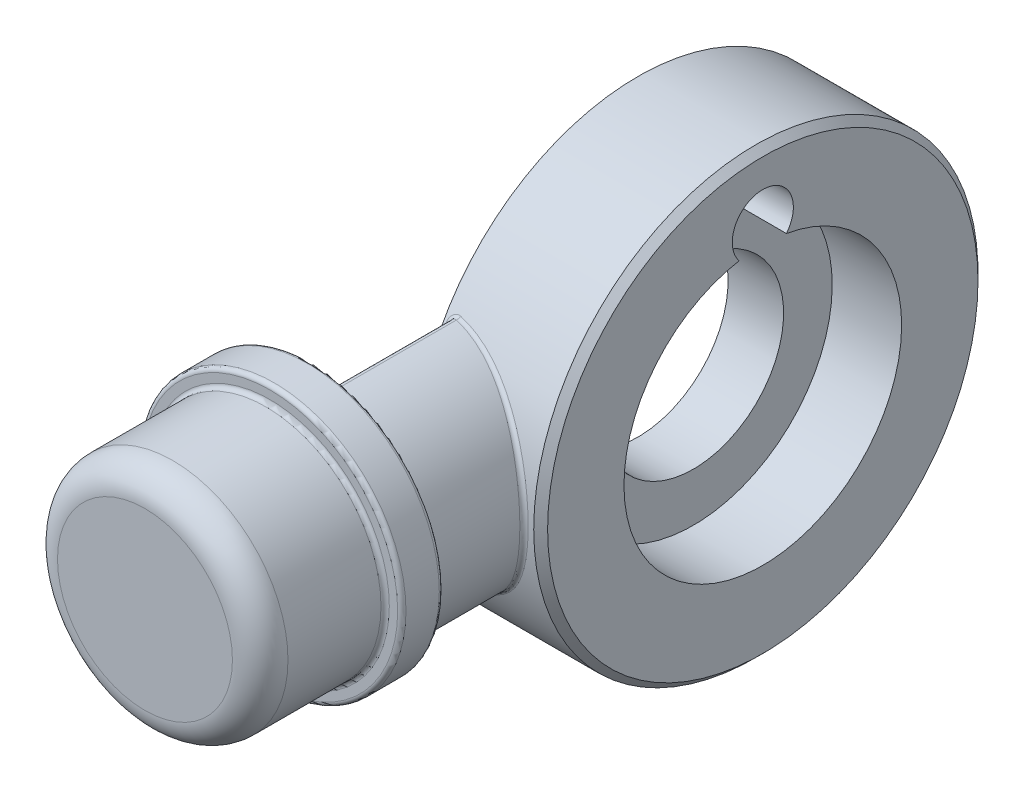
ISO-10303-21;
HEADER;
FILE_DESCRIPTION(('STEP AP214'),'2;1');
FILE_NAME('part.step','',(''),(''),'','','');
FILE_SCHEMA(('AUTOMOTIVE_DESIGN { 1 0 10303 214 1 1 1 1 }'));
ENDSEC;
DATA;
#1=APPLICATION_CONTEXT('core data for automotive mechanical design processes');
#2=APPLICATION_PROTOCOL_DEFINITION('international standard','automotive_design',2000,#1);
#3=PRODUCT_CONTEXT('',#1,'mechanical');
#4=PRODUCT('Part','Part','',(#3));
#5=PRODUCT_RELATED_PRODUCT_CATEGORY('part','',(#4));
#6=PRODUCT_DEFINITION_FORMATION('','',#4);
#7=PRODUCT_DEFINITION_CONTEXT('part definition',#1,'design');
#8=PRODUCT_DEFINITION('design','',#6,#7);
#9=PRODUCT_DEFINITION_SHAPE('','',#8);
#10=(LENGTH_UNIT() NAMED_UNIT(*) SI_UNIT(.MILLI.,.METRE.));
#11=(NAMED_UNIT(*) PLANE_ANGLE_UNIT() SI_UNIT($,.RADIAN.));
#12=(NAMED_UNIT(*) SI_UNIT($,.STERADIAN.) SOLID_ANGLE_UNIT());
#13=UNCERTAINTY_MEASURE_WITH_UNIT(LENGTH_MEASURE(1.E-05),#10,'distance_accuracy_value','');
#14=(GEOMETRIC_REPRESENTATION_CONTEXT(3) GLOBAL_UNCERTAINTY_ASSIGNED_CONTEXT((#13)) GLOBAL_UNIT_ASSIGNED_CONTEXT((#10,
#11,#12)) REPRESENTATION_CONTEXT('',''));
#15=CARTESIAN_POINT('',(0.,0.,0.));
#16=DIRECTION('',(0.,0.,1.));
#17=DIRECTION('',(1.,0.,0.));
#18=AXIS2_PLACEMENT_3D('',#15,#16,#17);
#19=CARTESIAN_POINT('',(0.,0.,35.));
#20=DIRECTION('',(0.,0.,1.));
#21=DIRECTION('',(0.,-1.,0.));
#22=AXIS2_PLACEMENT_3D('',#19,#20,#21);
#23=PLANE('',#22);
#24=CARTESIAN_POINT('',(0.,0.,35.));
#25=DIRECTION('',(0.,0.,-1.));
#26=DIRECTION('',(-1.,0.,0.));
#27=AXIS2_PLACEMENT_3D('',#24,#25,#26);
#28=CIRCLE('',#27,6.3);
#29=CARTESIAN_POINT('',(-6.3,0.,35.));
#30=VERTEX_POINT('',#29);
#31=CARTESIAN_POINT('',(6.3,0.,35.));
#32=VERTEX_POINT('',#31);
#33=EDGE_CURVE('E677',#30,#32,#28,.T.);
#34=ORIENTED_EDGE('',*,*,#33,.F.);
#35=CARTESIAN_POINT('',(0.,0.,35.));
#36=DIRECTION('',(0.,0.,-1.));
#37=DIRECTION('',(1.,0.,0.));
#38=AXIS2_PLACEMENT_3D('',#35,#36,#37);
#39=CIRCLE('',#38,6.3);
#40=EDGE_CURVE('E707',#32,#30,#39,.T.);
#41=ORIENTED_EDGE('',*,*,#40,.F.);
#42=EDGE_LOOP('',(#34,#41));
#43=FACE_BOUND('',#42,.T.);
#44=ADVANCED_FACE('F17',(#43),#23,.T.);
#45=CARTESIAN_POINT('',(0.,0.,33.));
#46=DIRECTION('',(0.,0.,1.));
#47=DIRECTION('',(1.,0.,0.));
#48=AXIS2_PLACEMENT_3D('',#45,#46,#47);
#49=TOROIDAL_SURFACE('',#48,6.3,2.);
#50=ORIENTED_EDGE('',*,*,#40,.T.);
#51=ORIENTED_EDGE('',*,*,#33,.T.);
#52=EDGE_LOOP('',(#50,#51));
#53=FACE_BOUND('',#52,.T.);
#54=CARTESIAN_POINT('',(0.,0.,33.));
#55=DIRECTION('',(0.,0.,-1.));
#56=DIRECTION('',(0.,1.,0.));
#57=AXIS2_PLACEMENT_3D('',#54,#55,#56);
#58=CIRCLE('',#57,8.3);
#59=CARTESIAN_POINT('',(0.,8.3,33.));
#60=VERTEX_POINT('',#59);
#61=EDGE_CURVE('E674',#60,#60,#58,.T.);
#62=ORIENTED_EDGE('',*,*,#61,.F.);
#63=EDGE_LOOP('',(#62));
#64=FACE_BOUND('',#63,.T.);
#65=ADVANCED_FACE('F682',(#53,#64),#49,.T.);
#66=CARTESIAN_POINT('',(0.,0.,35.));
#67=DIRECTION('',(0.,0.,-1.));
#68=DIRECTION('',(0.,1.,0.));
#69=AXIS2_PLACEMENT_3D('',#66,#67,#68);
#70=CYLINDRICAL_SURFACE('',#69,8.3);
#71=CARTESIAN_POINT('',(0.,0.,26.3));
#72=DIRECTION('',(0.,0.,1.));
#73=DIRECTION('',(1.,0.,0.));
#74=AXIS2_PLACEMENT_3D('',#71,#72,#73);
#75=CIRCLE('',#74,8.3);
#76=CARTESIAN_POINT('',(8.3,0.,26.3));
#77=VERTEX_POINT('',#76);
#78=EDGE_CURVE('E666',#77,#77,#75,.T.);
#79=ORIENTED_EDGE('',*,*,#78,.T.);
#80=EDGE_LOOP('',(#79));
#81=FACE_BOUND('',#80,.T.);
#82=ORIENTED_EDGE('',*,*,#61,.T.);
#83=EDGE_LOOP('',(#82));
#84=FACE_BOUND('',#83,.T.);
#85=ADVANCED_FACE('F656',(#81,#84),#70,.T.);
#86=CARTESIAN_POINT('',(0.,0.,26.3));
#87=DIRECTION('',(0.,0.,1.));
#88=DIRECTION('',(1.,0.,0.));
#89=AXIS2_PLACEMENT_3D('',#86,#87,#88);
#90=TOROIDAL_SURFACE('',#89,8.6,0.3);
#91=ORIENTED_EDGE('',*,*,#78,.F.);
#92=EDGE_LOOP('',(#91));
#93=FACE_BOUND('',#92,.T.);
#94=CARTESIAN_POINT('',(0.,0.,26.));
#95=DIRECTION('',(0.,0.,1.));
#96=DIRECTION('',(-1.,0.,0.));
#97=AXIS2_PLACEMENT_3D('',#94,#95,#96);
#98=CIRCLE('',#97,8.6);
#99=CARTESIAN_POINT('',(8.6,0.,26.));
#100=VERTEX_POINT('',#99);
#101=CARTESIAN_POINT('',(-8.6,0.,26.));
#102=VERTEX_POINT('',#101);
#103=EDGE_CURVE('E644',#100,#102,#98,.F.);
#104=ORIENTED_EDGE('',*,*,#103,.F.);
#105=CARTESIAN_POINT('',(0.,0.,26.));
#106=DIRECTION('',(0.,0.,1.));
#107=DIRECTION('',(1.,0.,0.));
#108=AXIS2_PLACEMENT_3D('',#105,#106,#107);
#109=CIRCLE('',#108,8.6);
#110=EDGE_CURVE('E662',#102,#100,#109,.F.);
#111=ORIENTED_EDGE('',*,*,#110,.F.);
#112=EDGE_LOOP('',(#104,#111));
#113=FACE_BOUND('',#112,.T.);
#114=ADVANCED_FACE('F647',(#93,#113),#90,.F.);
#115=CARTESIAN_POINT('',(0.,0.,26.));
#116=DIRECTION('',(0.,0.,1.));
#117=DIRECTION('',(0.,-1.,0.));
#118=AXIS2_PLACEMENT_3D('',#115,#116,#117);
#119=PLANE('',#118);
#120=CARTESIAN_POINT('',(0.,0.,26.));
#121=DIRECTION('',(0.,0.,-1.));
#122=DIRECTION('',(-1.,0.,0.));
#123=AXIS2_PLACEMENT_3D('',#120,#121,#122);
#124=CIRCLE('',#123,9.2);
#125=CARTESIAN_POINT('',(-9.2,0.,26.));
#126=VERTEX_POINT('',#125);
#127=CARTESIAN_POINT('',(9.2,0.,26.));
#128=VERTEX_POINT('',#127);
#129=EDGE_CURVE('E996',#126,#128,#124,.T.);
#130=ORIENTED_EDGE('',*,*,#129,.F.);
#131=CARTESIAN_POINT('',(0.,0.,26.));
#132=DIRECTION('',(0.,0.,-1.));
#133=DIRECTION('',(1.,0.,0.));
#134=AXIS2_PLACEMENT_3D('',#131,#132,#133);
#135=CIRCLE('',#134,9.2);
#136=EDGE_CURVE('E604',#128,#126,#135,.T.);
#137=ORIENTED_EDGE('',*,*,#136,.F.);
#138=EDGE_LOOP('',(#130,#137));
#139=FACE_BOUND('',#138,.T.);
#140=ORIENTED_EDGE('',*,*,#103,.T.);
#141=ORIENTED_EDGE('',*,*,#110,.T.);
#142=EDGE_LOOP('',(#140,#141));
#143=FACE_BOUND('',#142,.T.);
#144=ADVANCED_FACE('F619',(#139,#143),#119,.T.);
#145=CARTESIAN_POINT('',(0.,0.,25.7));
#146=DIRECTION('',(0.,0.,1.));
#147=DIRECTION('',(1.,0.,0.));
#148=AXIS2_PLACEMENT_3D('',#145,#146,#147);
#149=TOROIDAL_SURFACE('',#148,9.2,0.3);
#150=CARTESIAN_POINT('',(0.,0.,25.7));
#151=DIRECTION('',(0.,0.,1.));
#152=DIRECTION('',(0.,-1.,0.));
#153=AXIS2_PLACEMENT_3D('',#150,#151,#152);
#154=CIRCLE('',#153,9.5);
#155=CARTESIAN_POINT('',(0.,-9.5,25.7));
#156=VERTEX_POINT('',#155);
#157=EDGE_CURVE('E599',#156,#156,#154,.F.);
#158=ORIENTED_EDGE('',*,*,#157,.F.);
#159=EDGE_LOOP('',(#158));
#160=FACE_BOUND('',#159,.T.);
#161=ORIENTED_EDGE('',*,*,#136,.T.);
#162=ORIENTED_EDGE('',*,*,#129,.T.);
#163=EDGE_LOOP('',(#161,#162));
#164=FACE_BOUND('',#163,.T.);
#165=ADVANCED_FACE('F613',(#160,#164),#149,.T.);
#166=CARTESIAN_POINT('',(0.,0.,23.));
#167=DIRECTION('',(0.,0.,1.));
#168=DIRECTION('',(0.,-1.,0.));
#169=AXIS2_PLACEMENT_3D('',#166,#167,#168);
#170=CYLINDRICAL_SURFACE('',#169,9.5);
#171=CARTESIAN_POINT('',(0.,0.,23.3));
#172=DIRECTION('',(0.,0.,1.));
#173=DIRECTION('',(1.,0.,0.));
#174=AXIS2_PLACEMENT_3D('',#171,#172,#173);
#175=CIRCLE('',#174,9.5);
#176=CARTESIAN_POINT('',(9.5,0.,23.3));
#177=VERTEX_POINT('',#176);
#178=EDGE_CURVE('E596',#177,#177,#175,.F.);
#179=ORIENTED_EDGE('',*,*,#178,.F.);
#180=EDGE_LOOP('',(#179));
#181=FACE_BOUND('',#180,.T.);
#182=ORIENTED_EDGE('',*,*,#157,.T.);
#183=EDGE_LOOP('',(#182));
#184=FACE_BOUND('',#183,.T.);
#185=ADVANCED_FACE('F618',(#181,#184),#170,.T.);
#186=CARTESIAN_POINT('',(0.,0.,23.3));
#187=DIRECTION('',(0.,0.,1.));
#188=DIRECTION('',(1.,0.,0.));
#189=AXIS2_PLACEMENT_3D('',#186,#187,#188);
#190=TOROIDAL_SURFACE('',#189,9.2,0.3);
#191=CARTESIAN_POINT('',(0.,0.,23.));
#192=DIRECTION('',(0.,0.,1.));
#193=DIRECTION('',(1.,0.,0.));
#194=AXIS2_PLACEMENT_3D('',#191,#192,#193);
#195=CIRCLE('',#194,9.2);
#196=CARTESIAN_POINT('',(9.2,0.,23.));
#197=VERTEX_POINT('',#196);
#198=CARTESIAN_POINT('',(-9.2,0.,23.));
#199=VERTEX_POINT('',#198);
#200=EDGE_CURVE('E592',#197,#199,#195,.T.);
#201=ORIENTED_EDGE('',*,*,#200,.T.);
#202=CARTESIAN_POINT('',(0.,0.,23.));
#203=DIRECTION('',(0.,0.,1.));
#204=DIRECTION('',(-1.,0.,0.));
#205=AXIS2_PLACEMENT_3D('',#202,#203,#204);
#206=CIRCLE('',#205,9.2);
#207=EDGE_CURVE('E590',#199,#197,#206,.T.);
#208=ORIENTED_EDGE('',*,*,#207,.T.);
#209=EDGE_LOOP('',(#201,#208));
#210=FACE_BOUND('',#209,.T.);
#211=ORIENTED_EDGE('',*,*,#178,.T.);
#212=EDGE_LOOP('',(#211));
#213=FACE_BOUND('',#212,.T.);
#214=ADVANCED_FACE('F748',(#210,#213),#190,.T.);
#215=CARTESIAN_POINT('',(1.3,7.89366834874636,22.7));
#216=DIRECTION('',(0.,0.,1.));
#217=DIRECTION('',(1.,0.,0.));
#218=AXIS2_PLACEMENT_3D('',#215,#216,#217);
#219=TOROIDAL_SURFACE('',#218,0.6,0.3);
#220=CARTESIAN_POINT('',(1.3975,8.48569347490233,22.7));
#221=DIRECTION('',(-0.986708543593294,0.1625,0.));
#222=DIRECTION('',(0.1625,0.986708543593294,0.));
#223=AXIS2_PLACEMENT_3D('',#220,#221,#222);
#224=CIRCLE('',#223,0.3);
#225=CARTESIAN_POINT('',(1.3975,8.48569347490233,23.));
#226=VERTEX_POINT('',#225);
#227=CARTESIAN_POINT('',(1.34875,8.18968091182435,22.7));
#228=VERTEX_POINT('',#227);
#229=EDGE_CURVE('E237',#226,#228,#224,.F.);
#230=ORIENTED_EDGE('',*,*,#229,.T.);
#231=CARTESIAN_POINT('',(1.3,7.89366834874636,22.7));
#232=DIRECTION('',(0.,0.,-1.));
#233=DIRECTION('',(0.,1.,0.));
#234=AXIS2_PLACEMENT_3D('',#231,#232,#233);
#235=CIRCLE('',#234,0.3);
#236=CARTESIAN_POINT('',(1.,7.89366834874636,22.7));
#237=VERTEX_POINT('',#236);
#238=EDGE_CURVE('E500',#237,#228,#235,.T.);
#239=ORIENTED_EDGE('',*,*,#238,.F.);
#240=CARTESIAN_POINT('',(0.700000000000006,7.89366834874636,22.7));
#241=DIRECTION('',(0.,1.,0.));
#242=DIRECTION('',(0.,0.,1.));
#243=AXIS2_PLACEMENT_3D('',#240,#241,#242);
#244=CIRCLE('',#243,0.300000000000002);
#245=CARTESIAN_POINT('',(0.7,7.89366834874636,23.));
#246=VERTEX_POINT('',#245);
#247=EDGE_CURVE('E487',#237,#246,#244,.F.);
#248=ORIENTED_EDGE('',*,*,#247,.T.);
#249=CARTESIAN_POINT('',(1.3,7.89366834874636,23.));
#250=DIRECTION('',(0.,0.,-1.));
#251=DIRECTION('',(-1.,0.,0.));
#252=AXIS2_PLACEMENT_3D('',#249,#250,#251);
#253=CIRCLE('',#252,0.600000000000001);
#254=EDGE_CURVE('E529',#246,#226,#253,.T.);
#255=ORIENTED_EDGE('',*,*,#254,.T.);
#256=EDGE_LOOP('',(#230,#239,#248,#255));
#257=FACE_BOUND('',#256,.T.);
#258=ADVANCED_FACE('F528',(#257),#219,.F.);
#259=CARTESIAN_POINT('',(0.,0.,23.));
#260=DIRECTION('',(0.,0.,1.));
#261=DIRECTION('',(0.,-1.,0.));
#262=AXIS2_PLACEMENT_3D('',#259,#260,#261);
#263=PLANE('',#262);
#264=CARTESIAN_POINT('',(1.30000000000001,-7.89366834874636,23.));
#265=DIRECTION('',(0.,0.,-1.));
#266=DIRECTION('',(0.162500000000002,-0.986708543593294,0.));
#267=AXIS2_PLACEMENT_3D('',#264,#265,#266);
#268=CIRCLE('',#267,0.600000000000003);
#269=CARTESIAN_POINT('',(0.700000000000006,-7.89366834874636,23.));
#270=VERTEX_POINT('',#269);
#271=CARTESIAN_POINT('',(1.39750000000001,-8.48569347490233,23.));
#272=VERTEX_POINT('',#271);
#273=EDGE_CURVE('E240',#270,#272,#268,.F.);
#274=ORIENTED_EDGE('',*,*,#273,.T.);
#275=CARTESIAN_POINT('',(0.,0.,23.));
#276=DIRECTION('',(0.,0.,-1.));
#277=DIRECTION('',(1.,0.,0.));
#278=AXIS2_PLACEMENT_3D('',#275,#276,#277);
#279=CIRCLE('',#278,8.6);
#280=CARTESIAN_POINT('',(8.6,0.,23.));
#281=VERTEX_POINT('',#280);
#282=EDGE_CURVE('E201',#272,#281,#279,.F.);
#283=ORIENTED_EDGE('',*,*,#282,.T.);
#284=CARTESIAN_POINT('',(0.,0.,23.));
#285=DIRECTION('',(0.,0.,-1.));
#286=DIRECTION('',(0.1625,0.986708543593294,0.));
#287=AXIS2_PLACEMENT_3D('',#284,#285,#286);
#288=CIRCLE('',#287,8.6);
#289=EDGE_CURVE('E234',#281,#226,#288,.F.);
#290=ORIENTED_EDGE('',*,*,#289,.T.);
#291=ORIENTED_EDGE('',*,*,#254,.F.);
#292=DIRECTION('',(0.,1.,0.));
#293=VECTOR('',#292,1.);
#294=CARTESIAN_POINT('',(0.700000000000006,0.,23.));
#295=LINE('',#294,#293);
#296=EDGE_CURVE('E484',#246,#270,#295,.F.);
#297=ORIENTED_EDGE('',*,*,#296,.T.);
#298=EDGE_LOOP('',(#274,#283,#290,#291,#297));
#299=FACE_BOUND('',#298,.T.);
#300=ORIENTED_EDGE('',*,*,#200,.F.);
#301=ORIENTED_EDGE('',*,*,#207,.F.);
#302=EDGE_LOOP('',(#300,#301));
#303=FACE_BOUND('',#302,.T.);
#304=ADVANCED_FACE('F548',(#299,#303),#263,.F.);
#305=CARTESIAN_POINT('',(1.30000000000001,-7.89366834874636,22.7));
#306=DIRECTION('',(0.,0.,1.));
#307=DIRECTION('',(1.,0.,0.));
#308=AXIS2_PLACEMENT_3D('',#305,#306,#307);
#309=TOROIDAL_SURFACE('',#308,0.6,0.3);
#310=CARTESIAN_POINT('',(0.700000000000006,-7.89366834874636,22.7));
#311=DIRECTION('',(0.,1.,0.));
#312=DIRECTION('',(0.,0.,1.));
#313=AXIS2_PLACEMENT_3D('',#310,#311,#312);
#314=CIRCLE('',#313,0.300000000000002);
#315=CARTESIAN_POINT('',(1.,-7.89366834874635,22.7));
#316=VERTEX_POINT('',#315);
#317=EDGE_CURVE('E474',#270,#316,#314,.T.);
#318=ORIENTED_EDGE('',*,*,#317,.T.);
#319=CARTESIAN_POINT('',(1.30000000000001,-7.89366834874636,22.7));
#320=DIRECTION('',(0.,0.,-1.));
#321=DIRECTION('',(0.,1.,0.));
#322=AXIS2_PLACEMENT_3D('',#319,#320,#321);
#323=CIRCLE('',#322,0.3);
#324=CARTESIAN_POINT('',(1.34875000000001,-8.18968091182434,22.7));
#325=VERTEX_POINT('',#324);
#326=EDGE_CURVE('E467',#325,#316,#323,.T.);
#327=ORIENTED_EDGE('',*,*,#326,.F.);
#328=CARTESIAN_POINT('',(1.39750000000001,-8.48569347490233,22.7));
#329=DIRECTION('',(0.986708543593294,0.162500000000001,0.));
#330=DIRECTION('',(0.162500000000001,-0.986708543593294,0.));
#331=AXIS2_PLACEMENT_3D('',#328,#329,#330);
#332=CIRCLE('',#331,0.3);
#333=EDGE_CURVE('E232',#325,#272,#332,.T.);
#334=ORIENTED_EDGE('',*,*,#333,.T.);
#335=ORIENTED_EDGE('',*,*,#273,.F.);
#336=EDGE_LOOP('',(#318,#327,#334,#335));
#337=FACE_BOUND('',#336,.T.);
#338=ADVANCED_FACE('F220',(#337),#309,.F.);
#339=CARTESIAN_POINT('',(0.,0.,22.7));
#340=DIRECTION('',(0.,0.,1.));
#341=DIRECTION('',(1.,0.,0.));
#342=AXIS2_PLACEMENT_3D('',#339,#340,#341);
#343=TOROIDAL_SURFACE('',#342,8.6,0.3);
#344=ORIENTED_EDGE('',*,*,#282,.F.);
#345=ORIENTED_EDGE('',*,*,#333,.F.);
#346=CARTESIAN_POINT('',(0.,0.,22.7));
#347=DIRECTION('',(0.,0.,-1.));
#348=DIRECTION('',(0.,1.,0.));
#349=AXIS2_PLACEMENT_3D('',#346,#347,#348);
#350=CIRCLE('',#349,8.3);
#351=EDGE_CURVE('E450',#228,#325,#350,.T.);
#352=ORIENTED_EDGE('',*,*,#351,.F.);
#353=ORIENTED_EDGE('',*,*,#229,.F.);
#354=ORIENTED_EDGE('',*,*,#289,.F.);
#355=EDGE_LOOP('',(#344,#345,#352,#353,#354));
#356=FACE_BOUND('',#355,.T.);
#357=ADVANCED_FACE('F208',(#356),#343,.F.);
#358=CARTESIAN_POINT('',(1.3,7.89366834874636,26.));
#359=DIRECTION('',(0.,0.,-1.));
#360=DIRECTION('',(0.,1.,0.));
#361=AXIS2_PLACEMENT_3D('',#358,#359,#360);
#362=CYLINDRICAL_SURFACE('',#361,0.3);
#363=CARTESIAN_POINT('',(0.999999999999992,7.89366834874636,14.261135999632));
#364=CARTESIAN_POINT('',(0.999999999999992,7.97460862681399,14.1715336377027));
#365=CARTESIAN_POINT('',(1.03259023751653,8.0550001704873,14.0783770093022));
#366=CARTESIAN_POINT('',(1.12819710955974,8.14340371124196,13.9731857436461));
#367=CARTESIAN_POINT('',(1.16770625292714,8.16676278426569,13.9448846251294));
#368=CARTESIAN_POINT('',(1.25488815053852,8.19374688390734,13.9120784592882));
#369=CARTESIAN_POINT('',(1.30298677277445,8.19721760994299,13.9078134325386));
#370=CARTESIAN_POINT('',(1.34875,8.18968091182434,13.9170042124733));
#371=(BOUNDED_CURVE() B_SPLINE_CURVE(3,(#363,#364,#365,#366,#367,#368,#369,#370),.UNSPECIFIED.,
.F.,.F.) B_SPLINE_CURVE_WITH_KNOTS((4,2,2,4),(0.000253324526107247,0.00080841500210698,
0.00108596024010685,0.00136350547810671),
.UNSPECIFIED.) CURVE() GEOMETRIC_REPRESENTATION_ITEM() RATIONAL_B_SPLINE_CURVE((1.,1.,1.,1.,1.,
1.,1.,1.)) REPRESENTATION_ITEM(''));
#372=CARTESIAN_POINT('',(1.34874999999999,8.18968091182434,13.9170042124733));
#373=VERTEX_POINT('',#372);
#374=CARTESIAN_POINT('',(1.,7.89366834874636,14.261135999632));
#375=VERTEX_POINT('',#374);
#376=EDGE_CURVE('E490',#373,#375,#371,.F.);
#377=ORIENTED_EDGE('',*,*,#376,.T.);
#378=DIRECTION('',(0.,0.,-1.));
#379=VECTOR('',#378,1.);
#380=CARTESIAN_POINT('',(1.,7.89366834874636,26.));
#381=LINE('',#380,#379);
#382=EDGE_CURVE('E445',#375,#237,#381,.F.);
#383=ORIENTED_EDGE('',*,*,#382,.T.);
#384=ORIENTED_EDGE('',*,*,#238,.T.);
#385=DIRECTION('',(0.,0.,-1.));
#386=VECTOR('',#385,1.);
#387=CARTESIAN_POINT('',(1.34875,8.18968091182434,26.));
#388=LINE('',#387,#386);
#389=EDGE_CURVE('E438',#373,#228,#388,.F.);
#390=ORIENTED_EDGE('',*,*,#389,.F.);
#391=EDGE_LOOP('',(#377,#383,#384,#390));
#392=FACE_BOUND('',#391,.T.);
#393=ADVANCED_FACE('F219',(#392),#362,.T.);
#394=CARTESIAN_POINT('',(0.700000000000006,0.,22.7));
#395=DIRECTION('',(0.,1.,0.));
#396=DIRECTION('',(0.,0.,1.));
#397=AXIS2_PLACEMENT_3D('',#394,#395,#396);
#398=CYLINDRICAL_SURFACE('',#397,0.300000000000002);
#399=ORIENTED_EDGE('',*,*,#296,.F.);
#400=ORIENTED_EDGE('',*,*,#247,.F.);
#401=DIRECTION('',(0.,1.,0.));
#402=VECTOR('',#401,1.);
#403=CARTESIAN_POINT('',(1.,8.23953882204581,22.7));
#404=LINE('',#403,#402);
#405=EDGE_CURVE('E477',#237,#316,#404,.F.);
#406=ORIENTED_EDGE('',*,*,#405,.T.);
#407=ORIENTED_EDGE('',*,*,#317,.F.);
#408=EDGE_LOOP('',(#399,#400,#406,#407));
#409=FACE_BOUND('',#408,.T.);
#410=ADVANCED_FACE('F514',(#409),#398,.F.);
#411=CARTESIAN_POINT('',(1.30000000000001,-7.89366834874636,26.));
#412=DIRECTION('',(0.,0.,-1.));
#413=DIRECTION('',(0.,1.,0.));
#414=AXIS2_PLACEMENT_3D('',#411,#412,#413);
#415=CYLINDRICAL_SURFACE('',#414,0.3);
#416=CARTESIAN_POINT('',(1.34875000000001,-8.18968091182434,13.9170042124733));
#417=CARTESIAN_POINT('',(1.30310075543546,-8.19719883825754,13.9078363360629));
#418=CARTESIAN_POINT('',(1.2550160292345,-8.19375729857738,13.9120655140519));
#419=CARTESIAN_POINT('',(1.16792811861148,-8.1668605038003,13.9447661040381));
#420=CARTESIAN_POINT('',(1.12842382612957,-8.14352706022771,13.9730355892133));
#421=CARTESIAN_POINT('',(1.03310125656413,-8.05564395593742,14.0776176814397));
#422=CARTESIAN_POINT('',(1.00000000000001,-7.97437483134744,14.1717924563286));
#423=CARTESIAN_POINT('',(1.00000000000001,-7.89366834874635,14.261135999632));
#424=(BOUNDED_CURVE() B_SPLINE_CURVE(3,(#416,#417,#418,#419,#420,#421,#422,#423),.UNSPECIFIED.,
.F.,.F.) B_SPLINE_CURVE_WITH_KNOTS((4,2,2,4),(0.000378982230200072,0.000656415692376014,
0.000933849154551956,0.00148871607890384),
.UNSPECIFIED.) CURVE() GEOMETRIC_REPRESENTATION_ITEM() RATIONAL_B_SPLINE_CURVE((1.,1.,1.,1.,1.,
0.999999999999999,0.999999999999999,0.999999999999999)) REPRESENTATION_ITEM(''));
#425=CARTESIAN_POINT('',(1.00000000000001,-7.89366834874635,14.261135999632));
#426=VERTEX_POINT('',#425);
#427=CARTESIAN_POINT('',(1.34875000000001,-8.18968091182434,13.9170042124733));
#428=VERTEX_POINT('',#427);
#429=EDGE_CURVE('E246',#426,#428,#424,.F.);
#430=ORIENTED_EDGE('',*,*,#429,.T.);
#431=DIRECTION('',(0.,0.,-1.));
#432=VECTOR('',#431,1.);
#433=CARTESIAN_POINT('',(1.34875000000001,-8.18968091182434,26.));
#434=LINE('',#433,#432);
#435=EDGE_CURVE('E446',#325,#428,#434,.T.);
#436=ORIENTED_EDGE('',*,*,#435,.F.);
#437=ORIENTED_EDGE('',*,*,#326,.T.);
#438=DIRECTION('',(0.,0.,-1.));
#439=VECTOR('',#438,1.);
#440=CARTESIAN_POINT('',(1.,-7.89366834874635,26.));
#441=LINE('',#440,#439);
#442=EDGE_CURVE('E333',#316,#426,#441,.T.);
#443=ORIENTED_EDGE('',*,*,#442,.T.);
#444=EDGE_LOOP('',(#430,#436,#437,#443));
#445=FACE_BOUND('',#444,.T.);
#446=ADVANCED_FACE('F431',(#445),#415,.T.);
#447=CARTESIAN_POINT('',(0.,0.,26.));
#448=DIRECTION('',(0.,0.,-1.));
#449=DIRECTION('',(0.,1.,0.));
#450=AXIS2_PLACEMENT_3D('',#447,#448,#449);
#451=CYLINDRICAL_SURFACE('',#450,8.3);
#452=CARTESIAN_POINT('',(1.34874999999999,8.18968091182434,13.9170042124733));
#453=CARTESIAN_POINT('',(1.83594176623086,8.10944580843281,13.9676946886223));
#454=CARTESIAN_POINT('',(2.30821024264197,7.98741197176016,14.0439826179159));
#455=CARTESIAN_POINT('',(3.22536895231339,7.66313119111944,14.2366473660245));
#456=CARTESIAN_POINT('',(3.67407366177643,7.45810481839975,14.3544359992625));
#457=CARTESIAN_POINT('',(4.51237128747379,6.98288265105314,14.608818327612));
#458=CARTESIAN_POINT('',(4.90546558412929,6.71228630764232,14.7457822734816));
#459=CARTESIAN_POINT('',(5.64344459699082,6.10490893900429,15.0265066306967));
#460=CARTESIAN_POINT('',(5.99025011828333,5.76513277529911,15.1713035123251));
#461=CARTESIAN_POINT('',(6.61421280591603,5.03706674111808,15.4470700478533));
#462=CARTESIAN_POINT('',(6.89406313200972,4.64729327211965,15.5789891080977));
#463=CARTESIAN_POINT('',(7.2649785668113,4.02106288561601,15.7601242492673));
#464=CARTESIAN_POINT('',(7.38083294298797,3.80434342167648,15.8179278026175));
#465=CARTESIAN_POINT('',(7.5918819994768,3.36348799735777,15.9248038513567));
#466=CARTESIAN_POINT('',(7.68745693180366,3.13890056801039,15.9740535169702));
#467=CARTESIAN_POINT('',(7.94443962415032,2.45247680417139,16.1079327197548));
#468=CARTESIAN_POINT('',(8.07651351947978,1.97740987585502,16.1788272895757));
#469=CARTESIAN_POINT('',(8.25553983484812,0.993117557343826,16.2755492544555));
#470=CARTESIAN_POINT('',(8.29978780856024,0.49919819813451,16.2998839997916));
#471=CARTESIAN_POINT('',(8.30021068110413,-0.492117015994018,16.300115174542));
#472=CARTESIAN_POINT('',(8.25555492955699,-0.993093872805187,16.2755572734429));
#473=CARTESIAN_POINT('',(8.07643541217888,-1.97777998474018,16.178785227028));
#474=CARTESIAN_POINT('',(7.94424507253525,-2.45260347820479,16.1078383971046));
#475=CARTESIAN_POINT('',(7.60363575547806,-3.3631855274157,15.9303785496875));
#476=CARTESIAN_POINT('',(7.3949311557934,-3.8002902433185,15.8236657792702));
#477=CARTESIAN_POINT('',(6.89970675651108,-4.63910114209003,15.5816673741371));
#478=CARTESIAN_POINT('',(6.61843984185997,-5.03129881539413,15.4490476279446));
#479=CARTESIAN_POINT('',(5.99820496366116,-5.75667012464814,15.1747119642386));
#480=CARTESIAN_POINT('',(5.65820276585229,-6.09159916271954,15.0323971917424));
#481=CARTESIAN_POINT('',(4.91417973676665,-6.70624160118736,14.7488290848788));
#482=CARTESIAN_POINT('',(4.51898381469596,-6.97856860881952,14.611034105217));
#483=CARTESIAN_POINT('',(3.89131294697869,-7.33522952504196,14.4202556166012));
#484=CARTESIAN_POINT('',(3.67615465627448,-7.44548350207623,14.3592939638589));
#485=CARTESIAN_POINT('',(3.23317470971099,-7.64826247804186,14.2444155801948));
#486=CARTESIAN_POINT('',(3.00477082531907,-7.74088483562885,14.1904302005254));
#487=CARTESIAN_POINT('',(2.31249393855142,-7.9863730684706,14.0446417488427));
#488=CARTESIAN_POINT('',(1.83776563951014,-8.10914543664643,13.967884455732));
#489=CARTESIAN_POINT('',(1.34875000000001,-8.18968091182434,13.9170042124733));
#490=(BOUNDED_CURVE() B_SPLINE_CURVE(3,(#452,#453,#454,#455,#456,#457,#458,#459,#460,#461,#462,
#463,#464,#465,#466,#467,#468,#469,#470,#471,#472,#473,#474,#475,#476,#477,#478,#479,#480,#481,
#482,#483,#484,#485,#486,#487,#488,#489),.UNSPECIFIED.,.F.,.F.) B_SPLINE_CURVE_WITH_KNOTS((4,2,
2,2,2,2,2,2,2,2,2,2,2,2,2,2,2,2,4),(0.00305825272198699,0.00459779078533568,0.00613732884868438,
0.00767686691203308,0.00921640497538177,0.0107559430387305,0.0115257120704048,
0.0122954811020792,0.0138350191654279,0.0153745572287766,0.0169140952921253,0.0184536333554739,
0.0199931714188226,0.0215327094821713,0.02307224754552,0.0246117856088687,0.0253815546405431,
0.0261513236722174,0.0276908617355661),
.UNSPECIFIED.) CURVE() GEOMETRIC_REPRESENTATION_ITEM() RATIONAL_B_SPLINE_CURVE((1.,1.,1.,1.,1.,
1.,1.,1.,1.,1.,1.,1.,1.,1.,1.,1.,1.,1.,1.,1.,1.,1.,1.,1.,1.,1.,1.,1.,1.,1.,1.,1.,1.,1.,1.,1.,1.,1.)) REPRESENTATION_ITEM(''));
#491=EDGE_CURVE('E313',#428,#373,#490,.F.);
#492=ORIENTED_EDGE('',*,*,#491,.T.);
#493=ORIENTED_EDGE('',*,*,#389,.T.);
#494=ORIENTED_EDGE('',*,*,#351,.T.);
#495=ORIENTED_EDGE('',*,*,#435,.T.);
#496=EDGE_LOOP('',(#492,#493,#494,#495));
#497=FACE_BOUND('',#496,.T.);
#498=ADVANCED_FACE('F427',(#497),#451,.T.);
#499=CARTESIAN_POINT('',(1.,8.23953882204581,26.));
#500=DIRECTION('',(1.,0.,0.));
#501=DIRECTION('',(0.,0.,-1.));
#502=AXIS2_PLACEMENT_3D('',#499,#500,#501);
#503=PLANE('',#502);
#504=ORIENTED_EDGE('',*,*,#442,.F.);
#505=ORIENTED_EDGE('',*,*,#405,.F.);
#506=ORIENTED_EDGE('',*,*,#382,.F.);
#507=CARTESIAN_POINT('',(1.00000000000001,0.,0.));
#508=DIRECTION('',(-1.,0.,0.));
#509=DIRECTION('',(0.,-0.48427413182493,0.874916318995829));
#510=AXIS2_PLACEMENT_3D('',#507,#508,#509);
#511=CIRCLE('',#510,16.3);
#512=EDGE_CURVE('E144',#375,#426,#511,.F.);
#513=ORIENTED_EDGE('',*,*,#512,.T.);
#514=EDGE_LOOP('',(#504,#505,#506,#513));
#515=FACE_BOUND('',#514,.T.);
#516=ADVANCED_FACE('F416',(#515),#503,.F.);
#517=CARTESIAN_POINT('',(4.5,0.,0.));
#518=DIRECTION('',(1.,0.,0.));
#519=DIRECTION('',(0.,0.,-1.));
#520=AXIS2_PLACEMENT_3D('',#517,#518,#519);
#521=CYLINDRICAL_SURFACE('',#520,10.);
#522=CARTESIAN_POINT('',(4.5,0.,0.));
#523=DIRECTION('',(1.,0.,0.));
#524=DIRECTION('',(0.,0.,-1.));
#525=AXIS2_PLACEMENT_3D('',#522,#523,#524);
#526=CIRCLE('',#525,10.);
#527=CARTESIAN_POINT('',(4.49999999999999,9.85433333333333,1.70062181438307));
#528=VERTEX_POINT('',#527);
#529=CARTESIAN_POINT('',(4.5,9.85433333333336,-1.70062181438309));
#530=VERTEX_POINT('',#529);
#531=EDGE_CURVE('E322',#528,#530,#526,.T.);
#532=ORIENTED_EDGE('',*,*,#531,.F.);
#533=DIRECTION('',(-1.,0.,0.));
#534=VECTOR('',#533,1.);
#535=CARTESIAN_POINT('',(15.7225396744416,9.85433333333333,1.70062181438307));
#536=LINE('',#535,#534);
#537=CARTESIAN_POINT('',(9.49999999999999,9.85433333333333,1.70062181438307));
#538=VERTEX_POINT('',#537);
#539=EDGE_CURVE('E398',#528,#538,#536,.F.);
#540=ORIENTED_EDGE('',*,*,#539,.T.);
#541=CARTESIAN_POINT('',(9.49999999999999,0.,0.));
#542=DIRECTION('',(1.,0.,0.));
#543=DIRECTION('',(0.,0.,-1.));
#544=AXIS2_PLACEMENT_3D('',#541,#542,#543);
#545=CIRCLE('',#544,10.);
#546=CARTESIAN_POINT('',(9.49999999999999,9.85433333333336,-1.70062181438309));
#547=VERTEX_POINT('',#546);
#548=EDGE_CURVE('E326',#547,#538,#545,.F.);
#549=ORIENTED_EDGE('',*,*,#548,.F.);
#550=DIRECTION('',(-1.,0.,0.));
#551=VECTOR('',#550,1.);
#552=CARTESIAN_POINT('',(15.7225396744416,9.85433333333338,-1.70062181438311));
#553=LINE('',#552,#551);
#554=EDGE_CURVE('E147',#547,#530,#553,.T.);
#555=ORIENTED_EDGE('',*,*,#554,.T.);
#556=EDGE_LOOP('',(#532,#540,#549,#555));
#557=FACE_BOUND('',#556,.T.);
#558=ADVANCED_FACE('F426',(#557),#521,.F.);
#559=CARTESIAN_POINT('',(9.49999999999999,0.,0.));
#560=DIRECTION('',(1.,0.,0.));
#561=DIRECTION('',(0.,0.,-1.));
#562=AXIS2_PLACEMENT_3D('',#559,#560,#561);
#563=PLANE('',#562);
#564=CARTESIAN_POINT('',(9.49999999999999,0.,0.));
#565=DIRECTION('',(-1.,0.,0.));
#566=DIRECTION('',(0.,0.,1.));
#567=AXIS2_PLACEMENT_3D('',#564,#565,#566);
#568=CIRCLE('',#567,15.5);
#569=CARTESIAN_POINT('',(9.49999999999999,0.,15.5));
#570=VERTEX_POINT('',#569);
#571=EDGE_CURVE('E315',#570,#570,#568,.T.);
#572=ORIENTED_EDGE('',*,*,#571,.F.);
#573=EDGE_LOOP('',(#572));
#574=FACE_BOUND('',#573,.T.);
#575=CARTESIAN_POINT('',(9.49999999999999,11.25,0.));
#576=DIRECTION('',(-1.,0.,0.));
#577=DIRECTION('',(0.,0.,1.));
#578=AXIS2_PLACEMENT_3D('',#575,#576,#577);
#579=CIRCLE('',#578,2.2);
#580=EDGE_CURVE('E123',#538,#547,#579,.T.);
#581=ORIENTED_EDGE('',*,*,#580,.T.);
#582=ORIENTED_EDGE('',*,*,#548,.T.);
#583=EDGE_LOOP('',(#581,#582));
#584=FACE_BOUND('',#583,.T.);
#585=ADVANCED_FACE('F808',(#574,#584),#563,.T.);
#586=CARTESIAN_POINT('',(4.5,0.,0.));
#587=DIRECTION('',(1.,0.,0.));
#588=DIRECTION('',(0.,0.,-1.));
#589=AXIS2_PLACEMENT_3D('',#586,#587,#588);
#590=PLANE('',#589);
#591=CARTESIAN_POINT('',(4.5,0.,0.));
#592=DIRECTION('',(-1.,0.,0.));
#593=DIRECTION('',(0.,0.,1.));
#594=AXIS2_PLACEMENT_3D('',#591,#592,#593);
#595=CIRCLE('',#594,6.5);
#596=CARTESIAN_POINT('',(4.5,0.,6.5));
#597=VERTEX_POINT('',#596);
#598=EDGE_CURVE('E156',#597,#597,#595,.T.);
#599=ORIENTED_EDGE('',*,*,#598,.T.);
#600=EDGE_LOOP('',(#599));
#601=FACE_BOUND('',#600,.T.);
#602=CARTESIAN_POINT('',(4.49999999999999,11.25,0.));
#603=DIRECTION('',(-1.,0.,0.));
#604=DIRECTION('',(0.,0.,1.));
#605=AXIS2_PLACEMENT_3D('',#602,#603,#604);
#606=CIRCLE('',#605,2.2);
#607=EDGE_CURVE('E329',#530,#528,#606,.T.);
#608=ORIENTED_EDGE('',*,*,#607,.T.);
#609=ORIENTED_EDGE('',*,*,#531,.T.);
#610=EDGE_LOOP('',(#608,#609));
#611=FACE_BOUND('',#610,.T.);
#612=ADVANCED_FACE('F177',(#601,#611),#590,.T.);
#613=CARTESIAN_POINT('',(0.699999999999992,7.74838610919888,13.9986611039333));
#614=CARTESIAN_POINT('',(0.999999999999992,7.74838610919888,13.9986611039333));
#615=CARTESIAN_POINT('',(0.999999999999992,7.89366834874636,14.261135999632));
#616=CARTESIAN_POINT('',(0.700000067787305,7.90739790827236,13.9106466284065));
#617=CARTESIAN_POINT('',(0.963057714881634,7.83975219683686,13.9480891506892));
#618=CARTESIAN_POINT('',(0.999999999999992,7.97460862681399,14.1715336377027));
#619=CARTESIAN_POINT('',(0.765180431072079,8.06511120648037,13.8192657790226));
#620=CARTESIAN_POINT('',(0.968199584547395,7.96442830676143,13.877765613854));
#621=CARTESIAN_POINT('',(1.03259023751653,8.0550001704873,14.0783770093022));
#622=CARTESIAN_POINT('',(0.956394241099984,8.2386640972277,13.7160105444));
#623=CARTESIAN_POINT('',(1.07495383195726,8.10881034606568,13.7939280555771));
#624=CARTESIAN_POINT('',(1.12819710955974,8.14340371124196,13.9731857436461));
#625=CARTESIAN_POINT('',(1.0354125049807,8.28452242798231,13.6882303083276));
#626=CARTESIAN_POINT('',(1.12434027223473,8.14839590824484,13.7706046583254));
#627=CARTESIAN_POINT('',(1.16770625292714,8.16676278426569,13.9448846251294));
#628=CARTESIAN_POINT('',(1.20977630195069,8.33749734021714,13.6560279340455));
#629=CARTESIAN_POINT('',(1.23846700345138,8.19352700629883,13.7439125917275));
#630=CARTESIAN_POINT('',(1.25488815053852,8.19374688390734,13.9120784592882));
#631=CARTESIAN_POINT('',(1.30604484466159,8.34429949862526,13.6518484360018));
#632=CARTESIAN_POINT('',(1.3045656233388,8.19957304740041,13.7403041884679));
#633=CARTESIAN_POINT('',(1.30298677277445,8.19721760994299,13.9078134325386));
#634=CARTESIAN_POINT('',(1.3975,8.32951506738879,13.6608630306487));
#635=CARTESIAN_POINT('',(1.3652936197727,8.18695636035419,13.7477861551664));
#636=CARTESIAN_POINT('',(1.34875,8.18968091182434,13.9170042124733));
#637=(BOUNDED_SURFACE() B_SPLINE_SURFACE(3,2,((#613,#614,#615),(#616,#617,#618),(#619,#620,
#621),(#622,#623,#624),(#625,#626,#627),(#628,#629,#630),(#631,#632,#633),(#634,#635,#636)),
.UNSPECIFIED.,.F.,.F.,.F.) B_SPLINE_SURFACE_WITH_KNOTS((4,2,2,4),(3,3),(0.000253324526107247,
0.00080841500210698,0.00108596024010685,0.00136350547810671),(0.,1.),
.UNSPECIFIED.) GEOMETRIC_REPRESENTATION_ITEM() RATIONAL_B_SPLINE_SURFACE(((1.,0.707106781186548,
1.),(1.,0.753385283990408,1.),(1.,0.79739799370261,1.),(1.,0.845220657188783,1.),(1.,
0.85772218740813,1.),(1.,0.872140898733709,1.),(1.,0.874071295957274,1.),(1.,0.869964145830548,1.))) REPRESENTATION_ITEM('') SURFACE());
#638=CARTESIAN_POINT('',(1.39749999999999,8.48569347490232,13.9170042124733));
#639=DIRECTION('',(0.981900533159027,-0.161708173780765,0.0985992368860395));
#640=DIRECTION('',(-0.162500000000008,-0.986708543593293,0.));
#641=AXIS2_PLACEMENT_3D('',#638,#639,#640);
#642=CIRCLE('',#641,0.299999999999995);
#643=CARTESIAN_POINT('',(1.39749999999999,8.32951506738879,13.6608630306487));
#644=VERTEX_POINT('',#643);
#645=EDGE_CURVE('E153',#373,#644,#642,.T.);
#646=CARTESIAN_POINT('',(1.3975,8.32951506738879,13.6608630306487));
#647=CARTESIAN_POINT('',(1.30604484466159,8.34429949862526,13.6518484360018));
#648=CARTESIAN_POINT('',(1.20977630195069,8.33749734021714,13.6560279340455));
#649=CARTESIAN_POINT('',(1.0354125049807,8.28452242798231,13.6882303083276));
#650=CARTESIAN_POINT('',(0.956394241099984,8.2386640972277,13.7160105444));
#651=CARTESIAN_POINT('',(0.765180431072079,8.06511120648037,13.8192657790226));
#652=CARTESIAN_POINT('',(0.700000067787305,7.90739790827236,13.9106466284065));
#653=CARTESIAN_POINT('',(0.699999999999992,7.74838610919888,13.9986611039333));
#654=(BOUNDED_CURVE() B_SPLINE_CURVE(3,(#646,#647,#648,#649,#650,#651,#652,#653),.UNSPECIFIED.,
.F.,.F.) B_SPLINE_CURVE_WITH_KNOTS((4,2,2,4),(0.000253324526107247,0.000530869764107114,
0.00080841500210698,0.00136350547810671),
.UNSPECIFIED.) CURVE() GEOMETRIC_REPRESENTATION_ITEM() RATIONAL_B_SPLINE_CURVE((1.,1.,1.,1.,1.,
1.,1.,1.)) REPRESENTATION_ITEM(''));
#655=CARTESIAN_POINT('',(0.700000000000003,7.74838610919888,13.9986611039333));
#656=VERTEX_POINT('',#655);
#657=EDGE_CURVE('E132',#656,#644,#654,.F.);
#658=CARTESIAN_POINT('',(0.700000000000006,7.89366834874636,14.261135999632));
#659=DIRECTION('',(0.,-0.874916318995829,0.48427413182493));
#660=DIRECTION('',(0.,0.48427413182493,0.874916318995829));
#661=AXIS2_PLACEMENT_3D('',#658,#659,#660);
#662=CIRCLE('',#661,0.3);
#663=EDGE_CURVE('E141',#656,#375,#662,.T.);
#664=ORIENTED_EDGE('',*,*,#376,.F.);
#665=ORIENTED_EDGE('',*,*,#645,.T.);
#666=ORIENTED_EDGE('',*,*,#657,.F.);
#667=ORIENTED_EDGE('',*,*,#663,.T.);
#668=EDGE_LOOP('',(#664,#665,#666,#667));
#669=FACE_BOUND('',#668,.T.);
#670=ADVANCED_FACE('F151',(#669),#637,.F.);
#671=CARTESIAN_POINT('',(8.99999999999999,0.,0.));
#672=DIRECTION('',(-1.,0.,0.));
#673=DIRECTION('',(0.,0.,1.));
#674=AXIS2_PLACEMENT_3D('',#671,#672,#673);
#675=CONICAL_SURFACE('',#674,16.,0.785398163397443);
#676=ORIENTED_EDGE('',*,*,#571,.T.);
#677=EDGE_LOOP('',(#676));
#678=FACE_BOUND('',#677,.T.);
#679=CARTESIAN_POINT('',(8.99999999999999,0.,0.));
#680=DIRECTION('',(-1.,0.,0.));
#681=DIRECTION('',(0.,0.,1.));
#682=AXIS2_PLACEMENT_3D('',#679,#680,#681);
#683=CIRCLE('',#682,16.);
#684=CARTESIAN_POINT('',(8.99999999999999,0.,16.));
#685=VERTEX_POINT('',#684);
#686=EDGE_CURVE('E366',#685,#685,#683,.T.);
#687=ORIENTED_EDGE('',*,*,#686,.F.);
#688=EDGE_LOOP('',(#687));
#689=FACE_BOUND('',#688,.T.);
#690=ADVANCED_FACE('F176',(#678,#689),#675,.T.);
#691=CARTESIAN_POINT('',(1.34875000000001,-8.18968091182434,13.9170042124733));
#692=CARTESIAN_POINT('',(1.36529361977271,-8.18695636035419,13.7477861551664));
#693=CARTESIAN_POINT('',(1.39750000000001,-8.32951506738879,13.6608630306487));
#694=CARTESIAN_POINT('',(1.83776563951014,-8.10914543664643,13.967884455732));
#695=CARTESIAN_POINT('',(1.86175021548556,-8.10417740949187,13.797082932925));
#696=CARTESIAN_POINT('',(1.90418994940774,-8.24760464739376,13.7108067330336));
#697=CARTESIAN_POINT('',(2.31249393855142,-7.9863730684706,14.0446417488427));
#698=CARTESIAN_POINT('',(2.34316826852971,-7.97760660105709,13.8716261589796));
#699=CARTESIAN_POINT('',(2.39607805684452,-8.12273585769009,13.786151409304));
#700=CARTESIAN_POINT('',(3.00477082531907,-7.74088483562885,14.1904302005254));
#701=CARTESIAN_POINT('',(3.0397529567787,-7.72741374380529,14.0115741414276));
#702=CARTESIAN_POINT('',(3.11337699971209,-7.87305605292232,13.929256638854));
#703=CARTESIAN_POINT('',(3.23317470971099,-7.64826247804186,14.2444155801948));
#704=CARTESIAN_POINT('',(3.27028451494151,-7.63261584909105,14.0635937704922));
#705=CARTESIAN_POINT('',(3.35003644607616,-7.77885222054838,13.9822484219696));
#706=CARTESIAN_POINT('',(3.67615465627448,-7.44548350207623,14.3592939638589));
#707=CARTESIAN_POINT('',(3.71671581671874,-7.42556439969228,14.1740104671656));
#708=CARTESIAN_POINT('',(3.80902771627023,-7.57261090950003,14.0950124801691));
#709=CARTESIAN_POINT('',(3.89131294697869,-7.33522952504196,14.4202556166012));
#710=CARTESIAN_POINT('',(3.9333936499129,-7.31293123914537,14.2325986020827));
#711=CARTESIAN_POINT('',(4.03196281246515,-7.46047440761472,14.1548521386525));
#712=CARTESIAN_POINT('',(4.51898381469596,-6.97856860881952,14.611034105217));
#713=CARTESIAN_POINT('',(4.56755357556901,-6.94769755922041,14.4163673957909));
#714=CARTESIAN_POINT('',(4.68232057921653,-7.0977237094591,14.3421193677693));
#715=CARTESIAN_POINT('',(4.91417973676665,-6.70624160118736,14.7488290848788));
#716=CARTESIAN_POINT('',(4.96413409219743,-6.66938494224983,14.5484963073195));
#717=CARTESIAN_POINT('',(5.09180069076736,-6.82074687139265,14.4773782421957));
#718=CARTESIAN_POINT('',(5.65820276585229,-6.09159916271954,15.0323971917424));
#719=CARTESIAN_POINT('',(5.70800413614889,-6.04594462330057,14.8185584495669));
#720=CARTESIAN_POINT('',(5.86271611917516,-6.19560976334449,14.755727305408));
#721=CARTESIAN_POINT('',(5.99820496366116,-5.75667012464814,15.1747119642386));
#722=CARTESIAN_POINT('',(6.04600427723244,-5.70635596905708,14.9535306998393));
#723=CARTESIAN_POINT('',(6.21500755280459,-5.85496200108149,14.8954227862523));
#724=CARTESIAN_POINT('',(6.61843984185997,-5.03129881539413,15.4490476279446));
#725=CARTESIAN_POINT('',(6.66127807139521,-4.97547277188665,15.2124812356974));
#726=CARTESIAN_POINT('',(6.8576605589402,-5.11720538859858,15.1647093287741));
#727=CARTESIAN_POINT('',(6.89970675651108,-4.63910114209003,15.5816673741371));
#728=CARTESIAN_POINT('',(6.93792472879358,-4.58132290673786,15.3367015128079));
#729=CARTESIAN_POINT('',(7.14909374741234,-4.71831116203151,15.29488821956));
#730=CARTESIAN_POINT('',(7.3949311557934,-3.8002902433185,15.8236657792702));
#731=CARTESIAN_POINT('',(7.42452020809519,-3.74304904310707,15.5626787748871));
#732=CARTESIAN_POINT('',(7.66221782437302,-3.8651780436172,15.5324326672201));
#733=CARTESIAN_POINT('',(7.60363575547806,-3.3631855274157,15.9303785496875));
#734=CARTESIAN_POINT('',(7.62694018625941,-3.30896112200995,15.661060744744));
#735=CARTESIAN_POINT('',(7.87846596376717,-3.42061001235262,15.6371813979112));
#736=CARTESIAN_POINT('',(7.94424507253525,-2.45260347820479,16.1078383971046));
#737=CARTESIAN_POINT('',(7.95827610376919,-2.40686025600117,15.8249204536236));
#738=CARTESIAN_POINT('',(8.2313864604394,-2.49448029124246,15.8113751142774));
#739=CARTESIAN_POINT('',(8.07643541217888,-1.97777998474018,16.178785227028));
#740=CARTESIAN_POINT('',(8.08495742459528,-1.94011378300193,15.889442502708));
#741=CARTESIAN_POINT('',(8.36835476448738,-2.01154945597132,15.8810161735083));
#742=CARTESIAN_POINT('',(8.25555492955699,-0.993093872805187,16.2755572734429));
#743=CARTESIAN_POINT('',(8.25779488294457,-0.971495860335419,15.9779949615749));
#744=CARTESIAN_POINT('',(8.55394848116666,-1.01005038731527,15.9760071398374));
#745=CARTESIAN_POINT('',(8.30021068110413,-0.492117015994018,16.300115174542));
#746=CARTESIAN_POINT('',(8.30020264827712,-0.482738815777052,16.000105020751));
#747=CARTESIAN_POINT('',(8.60021829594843,-0.500519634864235,16.0001130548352));
#748=CARTESIAN_POINT('',(8.29978780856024,0.49919819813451,16.2998839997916));
#749=CARTESIAN_POINT('',(8.29979590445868,0.489671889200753,15.9998942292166));
#750=CARTESIAN_POINT('',(8.59978013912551,0.507721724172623,15.9998861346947));
#751=CARTESIAN_POINT('',(8.25553983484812,0.993117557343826,16.2755492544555));
#752=CARTESIAN_POINT('',(8.25777976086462,0.971521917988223,15.9779873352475));
#753=CARTESIAN_POINT('',(8.55393284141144,1.01007447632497,15.9759992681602));
#754=CARTESIAN_POINT('',(8.07651351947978,1.97740987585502,16.1788272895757));
#755=CARTESIAN_POINT('',(8.08503236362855,1.93975183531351,15.8894807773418));
#756=CARTESIAN_POINT('',(8.36843569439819,2.01117302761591,15.8810574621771));
#757=CARTESIAN_POINT('',(7.94443962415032,2.45247680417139,16.1079327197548));
#758=CARTESIAN_POINT('',(7.95848674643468,2.40668116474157,15.8250182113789));
#759=CARTESIAN_POINT('',(8.23158804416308,2.494351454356,15.8114677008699));
#760=CARTESIAN_POINT('',(7.68745693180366,3.13890056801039,15.9740535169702));
#761=CARTESIAN_POINT('',(7.70730509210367,3.08996245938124,15.7008077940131));
#762=CARTESIAN_POINT('',(7.96531682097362,3.19249551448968,15.6800525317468));
#763=CARTESIAN_POINT('',(7.5918819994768,3.36348799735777,15.9248038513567));
#764=CARTESIAN_POINT('',(7.6143153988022,3.31277908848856,15.6553041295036));
#765=CARTESIAN_POINT('',(7.86628737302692,3.42091764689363,15.6317093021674));
#766=CARTESIAN_POINT('',(7.38083294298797,3.80434342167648,15.8179278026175));
#767=CARTESIAN_POINT('',(7.40800505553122,3.75139037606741,15.5560758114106));
#768=CARTESIAN_POINT('',(7.64761003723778,3.86930042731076,15.5268002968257));
#769=CARTESIAN_POINT('',(7.2649785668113,4.02106288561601,15.7601242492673));
#770=CARTESIAN_POINT('',(7.29465000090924,3.96744550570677,15.5023309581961));
#771=CARTESIAN_POINT('',(7.52756815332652,4.08972025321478,15.4700606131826));
#772=CARTESIAN_POINT('',(6.89406313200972,4.64729327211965,15.5789891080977));
#773=CARTESIAN_POINT('',(6.93234871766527,4.58957406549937,15.3341842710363));
#774=CARTESIAN_POINT('',(7.14324613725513,4.72664316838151,15.2922592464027));
#775=CARTESIAN_POINT('',(6.61421280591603,5.03706674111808,15.4470700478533));
#776=CARTESIAN_POINT('',(6.65714387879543,4.98122784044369,15.2106391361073));
#777=CARTESIAN_POINT('',(6.85328073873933,5.1230717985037,15.1627681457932));
#778=CARTESIAN_POINT('',(5.99025011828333,5.76513277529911,15.1713035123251));
#779=CARTESIAN_POINT('',(6.03813580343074,5.71486313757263,14.9503207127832));
#780=CARTESIAN_POINT('',(6.20676518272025,5.86356914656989,14.8920770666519));
#781=CARTESIAN_POINT('',(5.64344459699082,6.10490893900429,15.0265066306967));
#782=CARTESIAN_POINT('',(5.69319476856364,6.05950700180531,14.8129272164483));
#783=CARTESIAN_POINT('',(5.84742452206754,6.20914679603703,14.7499451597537));
#784=CARTESIAN_POINT('',(4.90546558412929,6.71228630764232,14.7457822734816));
#785=CARTESIAN_POINT('',(4.95531610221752,6.67561416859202,14.5455519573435));
#786=CARTESIAN_POINT('',(5.08277156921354,6.82689478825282,14.4743875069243));
#787=CARTESIAN_POINT('',(4.51237128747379,6.98288265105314,14.608818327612));
#788=CARTESIAN_POINT('',(4.56092125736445,6.95209121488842,14.4142466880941));
#789=CARTESIAN_POINT('',(4.67546904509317,7.10211141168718,14.339944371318));
#790=CARTESIAN_POINT('',(3.67407366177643,7.45810481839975,14.3544359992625));
#791=CARTESIAN_POINT('',(3.717874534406,7.43648270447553,14.1703433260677));
#792=CARTESIAN_POINT('',(3.80687150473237,7.58544772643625,14.0902439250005));
#793=CARTESIAN_POINT('',(3.22536895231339,7.66313119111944,14.2366473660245));
#794=CARTESIAN_POINT('',(3.26476986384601,7.64708126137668,14.0565496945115));
#795=CARTESIAN_POINT('',(3.34194855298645,7.79397480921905,13.974623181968));
#796=CARTESIAN_POINT('',(2.30821024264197,7.98741197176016,14.0439826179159));
#797=CARTESIAN_POINT('',(2.33878855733,7.97869142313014,13.8709785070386));
#798=CARTESIAN_POINT('',(2.39163952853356,8.12379249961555,13.78550440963));
#799=CARTESIAN_POINT('',(1.83594176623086,8.10944580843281,13.9676946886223));
#800=CARTESIAN_POINT('',(1.85989264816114,8.10448713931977,13.7968984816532));
#801=CARTESIAN_POINT('',(1.90230012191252,8.24791015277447,13.7106204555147));
#802=CARTESIAN_POINT('',(1.34874999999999,8.18968091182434,13.9170042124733));
#803=CARTESIAN_POINT('',(1.36529361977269,8.18695636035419,13.7477861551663));
#804=CARTESIAN_POINT('',(1.39749999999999,8.32951506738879,13.6608630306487));
#805=(BOUNDED_SURFACE() B_SPLINE_SURFACE(3,2,((#691,#692,#693),(#694,#695,#696),(#697,#698,
#699),(#700,#701,#702),(#703,#704,#705),(#706,#707,#708),(#709,#710,#711),(#712,#713,#714),
(#715,#716,#717),(#718,#719,#720),(#721,#722,#723),(#724,#725,#726),(#727,#728,#729),(#730,#731,
#732),(#733,#734,#735),(#736,#737,#738),(#739,#740,#741),(#742,#743,#744),(#745,#746,#747),
(#748,#749,#750),(#751,#752,#753),(#754,#755,#756),(#757,#758,#759),(#760,#761,#762),(#763,#764,
#765),(#766,#767,#768),(#769,#770,#771),(#772,#773,#774),(#775,#776,#777),(#778,#779,#780),
(#781,#782,#783),(#784,#785,#786),(#787,#788,#789),(#790,#791,#792),(#793,#794,#795),(#796,#797,
#798),(#799,#800,#801),(#802,#803,#804)),.UNSPECIFIED.,.F.,.F.,
.F.) B_SPLINE_SURFACE_WITH_KNOTS((4,2,2,2,2,2,2,2,2,2,2,2,2,2,2,2,2,2,4),(3,3),
(0.00305825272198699,0.00459779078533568,0.00536755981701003,0.00613732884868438,
0.00767686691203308,0.00921640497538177,0.0107559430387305,0.0122954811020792,
0.0138350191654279,0.0153745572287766,0.0169140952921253,0.0184536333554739,0.0192234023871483,
0.0199931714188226,0.0215327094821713,0.02307224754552,0.0246117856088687,0.0261513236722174,
0.0276908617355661),(0.,1.),
.UNSPECIFIED.) GEOMETRIC_REPRESENTATION_ITEM() RATIONAL_B_SPLINE_SURFACE(((1.,0.869964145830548,
1.),(1.,0.867058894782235,1.),(1.,0.862655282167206,1.),(1.,0.854073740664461,1.),(1.,
0.850866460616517,1.),(1.,0.843950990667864,1.),(1.,0.840238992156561,1.),(1.,0.828453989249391,
1.),(1.,0.819722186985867,1.),(1.,0.801138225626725,1.),(1.,0.791511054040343,1.),(1.,
0.772349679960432,1.),(1.,0.762771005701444,1.),(1.,0.744789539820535,1.),(1.,0.736592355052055,
1.),(1.,0.722695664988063,1.),(1.,0.716984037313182,1.),(1.,0.709128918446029,1.),(1.,
0.707097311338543,1.),(1.,0.707116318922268,1.),(1.,0.709129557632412,1.),(1.,0.716980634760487,
1.),(1.,0.722688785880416,1.),(1.,0.733171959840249,1.),(1.,0.736988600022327,1.),(1.,
0.74515290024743,1.),(1.,0.749513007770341,1.),(1.,0.762965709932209,1.),(1.,0.772491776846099,
1.),(1.,0.791745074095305,1.),(1.,0.801530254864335,1.),(1.,0.819915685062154,1.),(1.,
0.82859333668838,1.),(1.,0.84430236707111,1.),(1.,0.851354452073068,1.),(1.,0.862692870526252,
1.),(1.,0.867069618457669,1.),(1.,0.869964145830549,1.))) REPRESENTATION_ITEM('') SURFACE());
#806=CARTESIAN_POINT('',(1.39750000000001,-8.32951506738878,13.6608630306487));
#807=CARTESIAN_POINT('',(1.90418994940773,-8.24760464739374,13.7108067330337));
#808=CARTESIAN_POINT('',(2.39607805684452,-8.12273585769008,13.786151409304));
#809=CARTESIAN_POINT('',(3.11337699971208,-7.87305605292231,13.929256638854));
#810=CARTESIAN_POINT('',(3.35003644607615,-7.77885222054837,13.9822484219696));
#811=CARTESIAN_POINT('',(3.80902771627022,-7.57261090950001,14.0950124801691));
#812=CARTESIAN_POINT('',(4.03196281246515,-7.46047440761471,14.1548521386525));
#813=CARTESIAN_POINT('',(4.68232057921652,-7.09772370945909,14.3421193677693));
#814=CARTESIAN_POINT('',(5.09180069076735,-6.82074687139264,14.4773782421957));
#815=CARTESIAN_POINT('',(5.86271611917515,-6.19560976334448,14.755727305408));
#816=CARTESIAN_POINT('',(6.21500755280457,-5.85496200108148,14.8954227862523));
#817=CARTESIAN_POINT('',(6.85766055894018,-5.11720538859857,15.1647093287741));
#818=CARTESIAN_POINT('',(7.14909374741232,-4.7183111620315,15.29488821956));
#819=CARTESIAN_POINT('',(7.662217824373,-3.86517804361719,15.5324326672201));
#820=CARTESIAN_POINT('',(7.87846596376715,-3.42061001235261,15.6371813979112));
#821=CARTESIAN_POINT('',(8.23138646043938,-2.49448029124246,15.8113751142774));
#822=CARTESIAN_POINT('',(8.36835476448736,-2.01154945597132,15.8810161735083));
#823=CARTESIAN_POINT('',(8.55394848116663,-1.01005038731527,15.9760071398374));
#824=CARTESIAN_POINT('',(8.60021829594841,-0.500519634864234,16.0001130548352));
#825=CARTESIAN_POINT('',(8.59978013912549,0.507721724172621,15.9998861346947));
#826=CARTESIAN_POINT('',(8.55393284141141,1.01007447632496,15.9759992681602));
#827=CARTESIAN_POINT('',(8.36843569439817,2.01117302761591,15.8810574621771));
#828=CARTESIAN_POINT('',(8.23158804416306,2.49435145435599,15.8114677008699));
#829=CARTESIAN_POINT('',(7.9653168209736,3.19249551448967,15.6800525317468));
#830=CARTESIAN_POINT('',(7.8662873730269,3.42091764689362,15.6317093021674));
#831=CARTESIAN_POINT('',(7.64761003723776,3.86930042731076,15.5268002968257));
#832=CARTESIAN_POINT('',(7.5275681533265,4.08972025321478,15.4700606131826));
#833=CARTESIAN_POINT('',(7.14324613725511,4.7266431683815,15.2922592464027));
#834=CARTESIAN_POINT('',(6.85328073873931,5.12307179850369,15.1627681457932));
#835=CARTESIAN_POINT('',(6.20676518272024,5.86356914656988,14.8920770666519));
#836=CARTESIAN_POINT('',(5.84742452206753,6.20914679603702,14.7499451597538));
#837=CARTESIAN_POINT('',(5.08277156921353,6.82689478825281,14.4743875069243));
#838=CARTESIAN_POINT('',(4.67546904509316,7.10211141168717,14.339944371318));
#839=CARTESIAN_POINT('',(3.80687150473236,7.58544772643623,14.0902439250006));
#840=CARTESIAN_POINT('',(3.34194855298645,7.79397480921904,13.974623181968));
#841=CARTESIAN_POINT('',(2.39163952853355,8.12379249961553,13.78550440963));
#842=CARTESIAN_POINT('',(1.90230012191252,8.24791015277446,13.7106204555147));
#843=CARTESIAN_POINT('',(1.39749999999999,8.32951506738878,13.6608630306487));
#844=(BOUNDED_CURVE() B_SPLINE_CURVE(3,(#806,#807,#808,#809,#810,#811,#812,#813,#814,#815,#816,
#817,#818,#819,#820,#821,#822,#823,#824,#825,#826,#827,#828,#829,#830,#831,#832,#833,#834,#835,
#836,#837,#838,#839,#840,#841,#842,#843),.UNSPECIFIED.,.F.,.F.) B_SPLINE_CURVE_WITH_KNOTS((4,2,
2,2,2,2,2,2,2,2,2,2,2,2,2,2,2,2,4),(0.00305825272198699,0.00459779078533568,0.00536755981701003,
0.00613732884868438,0.00767686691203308,0.00921640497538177,0.0107559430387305,
0.0122954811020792,0.0138350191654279,0.0153745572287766,0.0169140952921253,0.0184536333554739,
0.0192234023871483,0.0199931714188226,0.0215327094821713,0.02307224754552,0.0246117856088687,
0.0261513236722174,0.0276908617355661),
.UNSPECIFIED.) CURVE() GEOMETRIC_REPRESENTATION_ITEM() RATIONAL_B_SPLINE_CURVE((0.999999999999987,
0.999999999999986,0.999999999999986,0.999999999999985,0.999999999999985,0.999999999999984,
0.999999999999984,0.999999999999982,0.999999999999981,0.99999999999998,0.999999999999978,
0.999999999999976,0.999999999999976,0.999999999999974,0.999999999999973,0.999999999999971,
0.999999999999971,0.99999999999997,0.99999999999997,0.99999999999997,0.99999999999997,
0.999999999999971,0.999999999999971,0.999999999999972,0.999999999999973,0.999999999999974,
0.999999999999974,0.999999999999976,0.999999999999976,0.999999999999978,0.99999999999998,
0.999999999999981,0.999999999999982,0.999999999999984,0.999999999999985,0.999999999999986,
0.999999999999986,0.999999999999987)) REPRESENTATION_ITEM(''));
#845=CARTESIAN_POINT('',(8.59999999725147,1.12631499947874E-13,15.9999999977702));
#846=VERTEX_POINT('',#845);
#847=CARTESIAN_POINT('',(1.39750000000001,-8.32951506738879,13.6608630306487));
#848=VERTEX_POINT('',#847);
#849=EDGE_CURVE('E296',#846,#848,#844,.F.);
#850=CARTESIAN_POINT('',(1.39750000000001,-8.32951506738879,13.6608630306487));
#851=CARTESIAN_POINT('',(1.90418994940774,-8.24760464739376,13.7108067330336));
#852=CARTESIAN_POINT('',(2.39607805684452,-8.12273585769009,13.786151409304));
#853=CARTESIAN_POINT('',(3.11337699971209,-7.87305605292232,13.929256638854));
#854=CARTESIAN_POINT('',(3.35003644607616,-7.77885222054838,13.9822484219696));
#855=CARTESIAN_POINT('',(3.80902771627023,-7.57261090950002,14.0950124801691));
#856=CARTESIAN_POINT('',(4.03196281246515,-7.46047440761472,14.1548521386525));
#857=CARTESIAN_POINT('',(4.68232057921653,-7.0977237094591,14.3421193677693));
#858=CARTESIAN_POINT('',(5.09180069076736,-6.82074687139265,14.4773782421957));
#859=CARTESIAN_POINT('',(5.86271611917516,-6.19560976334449,14.755727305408));
#860=CARTESIAN_POINT('',(6.21500755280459,-5.85496200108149,14.8954227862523));
#861=CARTESIAN_POINT('',(6.8576605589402,-5.11720538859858,15.1647093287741));
#862=CARTESIAN_POINT('',(7.14909374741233,-4.71831116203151,15.29488821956));
#863=CARTESIAN_POINT('',(7.66221782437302,-3.8651780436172,15.5324326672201));
#864=CARTESIAN_POINT('',(7.87846596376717,-3.42061001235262,15.6371813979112));
#865=CARTESIAN_POINT('',(8.2313864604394,-2.49448029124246,15.8113751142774));
#866=CARTESIAN_POINT('',(8.36835476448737,-2.01154945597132,15.8810161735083));
#867=CARTESIAN_POINT('',(8.55394848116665,-1.01005038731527,15.9760071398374));
#868=CARTESIAN_POINT('',(8.60021829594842,-0.500519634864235,16.0001130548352));
#869=CARTESIAN_POINT('',(8.5997801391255,0.507721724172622,15.9998861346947));
#870=CARTESIAN_POINT('',(8.55393284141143,1.01007447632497,15.9759992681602));
#871=CARTESIAN_POINT('',(8.36843569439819,2.01117302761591,15.8810574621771));
#872=CARTESIAN_POINT('',(8.23158804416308,2.494351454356,15.8114677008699));
#873=CARTESIAN_POINT('',(7.96531682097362,3.19249551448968,15.6800525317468));
#874=CARTESIAN_POINT('',(7.86628737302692,3.42091764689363,15.6317093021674));
#875=CARTESIAN_POINT('',(7.64761003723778,3.86930042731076,15.5268002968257));
#876=CARTESIAN_POINT('',(7.52756815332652,4.08972025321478,15.4700606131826));
#877=CARTESIAN_POINT('',(7.14324613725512,4.72664316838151,15.2922592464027));
#878=CARTESIAN_POINT('',(6.85328073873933,5.1230717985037,15.1627681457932));
#879=CARTESIAN_POINT('',(6.20676518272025,5.86356914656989,14.8920770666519));
#880=CARTESIAN_POINT('',(5.84742452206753,6.20914679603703,14.7499451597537));
#881=CARTESIAN_POINT('',(5.08277156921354,6.82689478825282,14.4743875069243));
#882=CARTESIAN_POINT('',(4.67546904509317,7.10211141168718,14.339944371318));
#883=CARTESIAN_POINT('',(3.80687150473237,7.58544772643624,14.0902439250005));
#884=CARTESIAN_POINT('',(3.34194855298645,7.79397480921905,13.974623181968));
#885=CARTESIAN_POINT('',(2.39163952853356,8.12379249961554,13.78550440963));
#886=CARTESIAN_POINT('',(1.90230012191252,8.24791015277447,13.7106204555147));
#887=CARTESIAN_POINT('',(1.39749999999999,8.32951506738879,13.6608630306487));
#888=(BOUNDED_CURVE() B_SPLINE_CURVE(3,(#850,#851,#852,#853,#854,#855,#856,#857,#858,#859,#860,
#861,#862,#863,#864,#865,#866,#867,#868,#869,#870,#871,#872,#873,#874,#875,#876,#877,#878,#879,
#880,#881,#882,#883,#884,#885,#886,#887),.UNSPECIFIED.,.F.,.F.) B_SPLINE_CURVE_WITH_KNOTS((4,2,
2,2,2,2,2,2,2,2,2,2,2,2,2,2,2,2,4),(0.00305825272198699,0.00459779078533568,0.00536755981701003,
0.00613732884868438,0.00767686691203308,0.00921640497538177,0.0107559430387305,
0.0122954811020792,0.0138350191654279,0.0153745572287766,0.0169140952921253,0.0184536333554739,
0.0192234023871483,0.0199931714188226,0.0215327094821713,0.02307224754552,0.0246117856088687,
0.0261513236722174,0.0276908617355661),
.UNSPECIFIED.) CURVE() GEOMETRIC_REPRESENTATION_ITEM() RATIONAL_B_SPLINE_CURVE((0.999999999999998,
0.999999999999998,0.999999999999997,0.999999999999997,0.999999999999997,0.999999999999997,
0.999999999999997,0.999999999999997,0.999999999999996,0.999999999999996,0.999999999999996,
0.999999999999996,0.999999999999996,0.999999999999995,0.999999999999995,0.999999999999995,
0.999999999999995,0.999999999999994,0.999999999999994,0.999999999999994,0.999999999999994,
0.999999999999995,0.999999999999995,0.999999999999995,0.999999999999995,0.999999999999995,
0.999999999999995,0.999999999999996,0.999999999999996,0.999999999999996,0.999999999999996,
0.999999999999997,0.999999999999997,0.999999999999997,0.999999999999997,0.999999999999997,
0.999999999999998,0.999999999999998)) REPRESENTATION_ITEM(''));
#889=EDGE_CURVE('E155',#644,#846,#888,.F.);
#890=CARTESIAN_POINT('',(1.39750000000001,-8.48569347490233,13.9170042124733));
#891=DIRECTION('',(-0.981900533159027,-0.161708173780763,-0.0985992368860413));
#892=DIRECTION('',(0.,0.520594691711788,-0.853803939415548));
#893=AXIS2_PLACEMENT_3D('',#890,#891,#892);
#894=CIRCLE('',#893,0.300000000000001);
#895=EDGE_CURVE('E283',#428,#848,#894,.T.);
#896=ORIENTED_EDGE('',*,*,#849,.F.);
#897=ORIENTED_EDGE('',*,*,#889,.F.);
#898=ORIENTED_EDGE('',*,*,#645,.F.);
#899=ORIENTED_EDGE('',*,*,#491,.F.);
#900=ORIENTED_EDGE('',*,*,#895,.T.);
#901=EDGE_LOOP('',(#896,#897,#898,#899,#900));
#902=FACE_BOUND('',#901,.T.);
#903=ADVANCED_FACE('F264',(#902),#805,.F.);
#904=CARTESIAN_POINT('',(1.39750000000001,-8.32951506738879,13.6608630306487));
#905=CARTESIAN_POINT('',(1.36529361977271,-8.18695636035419,13.7477861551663));
#906=CARTESIAN_POINT('',(1.34875000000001,-8.18968091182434,13.9170042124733));
#907=CARTESIAN_POINT('',(1.30628477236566,-8.34426069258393,13.6518720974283));
#908=CARTESIAN_POINT('',(1.30471982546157,-8.1995409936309,13.7403231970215));
#909=CARTESIAN_POINT('',(1.30310075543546,-8.19719883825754,13.9078363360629));
#910=CARTESIAN_POINT('',(1.21003206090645,-8.33751778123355,13.6560152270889));
#911=CARTESIAN_POINT('',(1.23864252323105,-8.19354632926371,13.7439009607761));
#912=CARTESIAN_POINT('',(1.2550160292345,-8.19375729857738,13.9120655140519));
#913=CARTESIAN_POINT('',(1.03585623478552,-8.28471427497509,13.6881139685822));
#914=CARTESIAN_POINT('',(1.12462662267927,-8.14855986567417,13.7705078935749));
#915=CARTESIAN_POINT('',(1.16792811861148,-8.1668605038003,13.9447661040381));
#916=CARTESIAN_POINT('',(0.956847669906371,-8.23890625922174,13.7158631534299));
#917=CARTESIAN_POINT('',(1.07524538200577,-8.10902866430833,13.7937991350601));
#918=CARTESIAN_POINT('',(1.12842382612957,-8.14352706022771,13.9730355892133));
#919=CARTESIAN_POINT('',(0.766202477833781,-8.06637507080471,13.8185204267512));
#920=CARTESIAN_POINT('',(0.968705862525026,-7.96548318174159,13.8771576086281));
#921=CARTESIAN_POINT('',(1.03310125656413,-8.05564395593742,14.0776176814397));
#922=CARTESIAN_POINT('',(0.700000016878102,-7.90695226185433,13.9108932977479));
#923=CARTESIAN_POINT('',(0.963143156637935,-7.83954077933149,13.9482061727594));
#924=CARTESIAN_POINT('',(1.00000000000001,-7.97437483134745,14.1717924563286));
#925=CARTESIAN_POINT('',(0.70000000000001,-7.74838610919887,13.9986611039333));
#926=CARTESIAN_POINT('',(1.00000000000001,-7.74838610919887,13.9986611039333));
#927=CARTESIAN_POINT('',(1.00000000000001,-7.89366834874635,14.261135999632));
#928=(BOUNDED_SURFACE() B_SPLINE_SURFACE(3,2,((#904,#905,#906),(#907,#908,#909),(#910,#911,
#912),(#913,#914,#915),(#916,#917,#918),(#919,#920,#921),(#922,#923,#924),(#925,#926,#927)),
.UNSPECIFIED.,.F.,.F.,.F.) B_SPLINE_SURFACE_WITH_KNOTS((4,2,2,4),(3,3),(0.000378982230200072,
0.000656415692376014,0.000933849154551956,0.00148871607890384),(0.,1.),
.UNSPECIFIED.) GEOMETRIC_REPRESENTATION_ITEM() RATIONAL_B_SPLINE_SURFACE(((1.,0.869964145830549,
1.),(1.,0.874078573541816,1.),(1.,0.872146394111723,1.),(1.,0.857774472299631,1.),(1.,
0.845286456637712,1.),(1.,0.797748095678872,1.),(1.,0.753266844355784,1.),(1.,0.707106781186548,1.))) REPRESENTATION_ITEM('') SURFACE());
#929=CARTESIAN_POINT('',(0.70000000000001,-7.74838610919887,13.9986611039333));
#930=CARTESIAN_POINT('',(0.700000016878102,-7.90695226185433,13.9108932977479));
#931=CARTESIAN_POINT('',(0.766202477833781,-8.06637507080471,13.8185204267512));
#932=CARTESIAN_POINT('',(0.956847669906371,-8.23890625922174,13.7158631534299));
#933=CARTESIAN_POINT('',(1.03585623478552,-8.28471427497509,13.6881139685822));
#934=CARTESIAN_POINT('',(1.21003206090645,-8.33751778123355,13.6560152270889));
#935=CARTESIAN_POINT('',(1.30628477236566,-8.34426069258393,13.6518720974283));
#936=CARTESIAN_POINT('',(1.39750000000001,-8.32951506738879,13.6608630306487));
#937=(BOUNDED_CURVE() B_SPLINE_CURVE(3,(#929,#930,#931,#932,#933,#934,#935,#936),.UNSPECIFIED.,
.F.,.F.) B_SPLINE_CURVE_WITH_KNOTS((4,2,2,4),(0.000378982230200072,0.000933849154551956,
0.0012112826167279,0.00148871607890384),
.UNSPECIFIED.) CURVE() GEOMETRIC_REPRESENTATION_ITEM() RATIONAL_B_SPLINE_CURVE((1.,1.,1.,1.,1.,
1.,1.,1.)) REPRESENTATION_ITEM(''));
#938=CARTESIAN_POINT('',(0.700000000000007,-7.74838610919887,13.9986611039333));
#939=VERTEX_POINT('',#938);
#940=EDGE_CURVE('E37',#848,#939,#937,.F.);
#941=CARTESIAN_POINT('',(0.700000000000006,-7.89366834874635,14.261135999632));
#942=DIRECTION('',(0.,-0.874916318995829,-0.48427413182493));
#943=DIRECTION('',(0.,-0.48427413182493,0.874916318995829));
#944=AXIS2_PLACEMENT_3D('',#941,#942,#943);
#945=CIRCLE('',#944,0.3);
#946=EDGE_CURVE('E148',#426,#939,#945,.F.);
#947=ORIENTED_EDGE('',*,*,#940,.F.);
#948=ORIENTED_EDGE('',*,*,#895,.F.);
#949=ORIENTED_EDGE('',*,*,#429,.F.);
#950=ORIENTED_EDGE('',*,*,#946,.T.);
#951=EDGE_LOOP('',(#947,#948,#949,#950));
#952=FACE_BOUND('',#951,.T.);
#953=ADVANCED_FACE('F253',(#952),#928,.F.);
#954=CARTESIAN_POINT('',(0.700000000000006,0.,0.));
#955=DIRECTION('',(1.,0.,0.));
#956=DIRECTION('',(0.,0.,-1.));
#957=AXIS2_PLACEMENT_3D('',#954,#955,#956);
#958=TOROIDAL_SURFACE('',#957,16.3,0.3);
#959=ORIENTED_EDGE('',*,*,#663,.F.);
#960=CARTESIAN_POINT('',(0.700000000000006,0.,0.));
#961=DIRECTION('',(-1.,0.,0.));
#962=DIRECTION('',(0.,0.,1.));
#963=AXIS2_PLACEMENT_3D('',#960,#961,#962);
#964=CIRCLE('',#963,16.);
#965=EDGE_CURVE('E126',#939,#656,#964,.T.);
#966=ORIENTED_EDGE('',*,*,#965,.F.);
#967=ORIENTED_EDGE('',*,*,#946,.F.);
#968=ORIENTED_EDGE('',*,*,#512,.F.);
#969=EDGE_LOOP('',(#959,#966,#967,#968));
#970=FACE_BOUND('',#969,.T.);
#971=ADVANCED_FACE('F142',(#970),#958,.F.);
#972=CARTESIAN_POINT('',(15.7225396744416,11.25,0.));
#973=DIRECTION('',(-1.,0.,0.));
#974=DIRECTION('',(0.,0.,1.));
#975=AXIS2_PLACEMENT_3D('',#972,#973,#974);
#976=CYLINDRICAL_SURFACE('',#975,2.2);
#977=ORIENTED_EDGE('',*,*,#580,.F.);
#978=ORIENTED_EDGE('',*,*,#539,.F.);
#979=ORIENTED_EDGE('',*,*,#607,.F.);
#980=ORIENTED_EDGE('',*,*,#554,.F.);
#981=EDGE_LOOP('',(#977,#978,#979,#980));
#982=FACE_BOUND('',#981,.T.);
#983=CARTESIAN_POINT('',(0.5,11.25,0.));
#984=DIRECTION('',(-1.,0.,0.));
#985=DIRECTION('',(0.,0.,1.));
#986=AXIS2_PLACEMENT_3D('',#983,#984,#985);
#987=CIRCLE('',#986,2.2);
#988=CARTESIAN_POINT('',(0.5,11.25,2.2));
#989=VERTEX_POINT('',#988);
#990=EDGE_CURVE('E137',#989,#989,#987,.T.);
#991=ORIENTED_EDGE('',*,*,#990,.T.);
#992=EDGE_LOOP('',(#991));
#993=FACE_BOUND('',#992,.T.);
#994=ADVANCED_FACE('F854',(#982,#993),#976,.F.);
#995=CARTESIAN_POINT('',(27.8847763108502,0.,0.));
#996=DIRECTION('',(-1.,0.,0.));
#997=DIRECTION('',(0.,0.,1.));
#998=AXIS2_PLACEMENT_3D('',#995,#996,#997);
#999=CYLINDRICAL_SURFACE('',#998,6.5);
#1000=ORIENTED_EDGE('',*,*,#598,.F.);
#1001=EDGE_LOOP('',(#1000));
#1002=FACE_BOUND('',#1001,.T.);
#1003=CARTESIAN_POINT('',(0.5,0.,0.));
#1004=DIRECTION('',(-1.,0.,0.));
#1005=DIRECTION('',(0.,0.,1.));
#1006=AXIS2_PLACEMENT_3D('',#1003,#1004,#1005);
#1007=CIRCLE('',#1006,6.5);
#1008=CARTESIAN_POINT('',(0.5,0.,6.5));
#1009=VERTEX_POINT('',#1008);
#1010=EDGE_CURVE('E28',#1009,#1009,#1007,.T.);
#1011=ORIENTED_EDGE('',*,*,#1010,.T.);
#1012=EDGE_LOOP('',(#1011));
#1013=FACE_BOUND('',#1012,.T.);
#1014=ADVANCED_FACE('F349',(#1002,#1013),#999,.F.);
#1015=CARTESIAN_POINT('',(9.49999999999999,0.,0.));
#1016=DIRECTION('',(-1.,0.,0.));
#1017=DIRECTION('',(0.,0.,1.));
#1018=AXIS2_PLACEMENT_3D('',#1015,#1016,#1017);
#1019=CYLINDRICAL_SURFACE('',#1018,16.);
#1020=ORIENTED_EDGE('',*,*,#686,.T.);
#1021=EDGE_LOOP('',(#1020));
#1022=FACE_BOUND('',#1021,.T.);
#1023=ORIENTED_EDGE('',*,*,#889,.T.);
#1024=ORIENTED_EDGE('',*,*,#849,.T.);
#1025=ORIENTED_EDGE('',*,*,#940,.T.);
#1026=ORIENTED_EDGE('',*,*,#965,.T.);
#1027=ORIENTED_EDGE('',*,*,#657,.T.);
#1028=EDGE_LOOP('',(#1023,#1024,#1025,#1026,#1027));
#1029=FACE_BOUND('',#1028,.T.);
#1030=CARTESIAN_POINT('',(0.5,0.,0.));
#1031=DIRECTION('',(-1.,0.,0.));
#1032=DIRECTION('',(0.,0.,1.));
#1033=AXIS2_PLACEMENT_3D('',#1030,#1031,#1032);
#1034=CIRCLE('',#1033,16.);
#1035=CARTESIAN_POINT('',(0.5,0.,16.));
#1036=VERTEX_POINT('',#1035);
#1037=EDGE_CURVE('E11',#1036,#1036,#1034,.F.);
#1038=ORIENTED_EDGE('',*,*,#1037,.T.);
#1039=EDGE_LOOP('',(#1038));
#1040=FACE_BOUND('',#1039,.T.);
#1041=ADVANCED_FACE('F129',(#1022,#1029,#1040),#1019,.T.);
#1042=CARTESIAN_POINT('',(0.5,0.,0.));
#1043=DIRECTION('',(1.,0.,0.));
#1044=DIRECTION('',(0.,0.,-1.));
#1045=AXIS2_PLACEMENT_3D('',#1042,#1043,#1044);
#1046=PLANE('',#1045);
#1047=ORIENTED_EDGE('',*,*,#1037,.F.);
#1048=EDGE_LOOP('',(#1047));
#1049=FACE_BOUND('',#1048,.T.);
#1050=ORIENTED_EDGE('',*,*,#1010,.F.);
#1051=EDGE_LOOP('',(#1050));
#1052=FACE_BOUND('',#1051,.T.);
#1053=ORIENTED_EDGE('',*,*,#990,.F.);
#1054=EDGE_LOOP('',(#1053));
#1055=FACE_BOUND('',#1054,.T.);
#1056=ADVANCED_FACE('F348',(#1049,#1052,#1055),#1046,.F.);
#1057=CLOSED_SHELL('',(#44,#65,#85,#114,#144,#165,#185,#214,#258,#304,#338,#357,#393,#410,#446,
#498,#516,#558,#585,#612,#670,#690,#903,#953,#971,#994,#1014,#1041,#1056));
#1058=MANIFOLD_SOLID_BREP('B1',#1057);
#1059=ADVANCED_BREP_SHAPE_REPRESENTATION('',(#18,#1058),#14);
#1060=SHAPE_DEFINITION_REPRESENTATION(#9,#1059);
ENDSEC;
END-ISO-10303-21;
